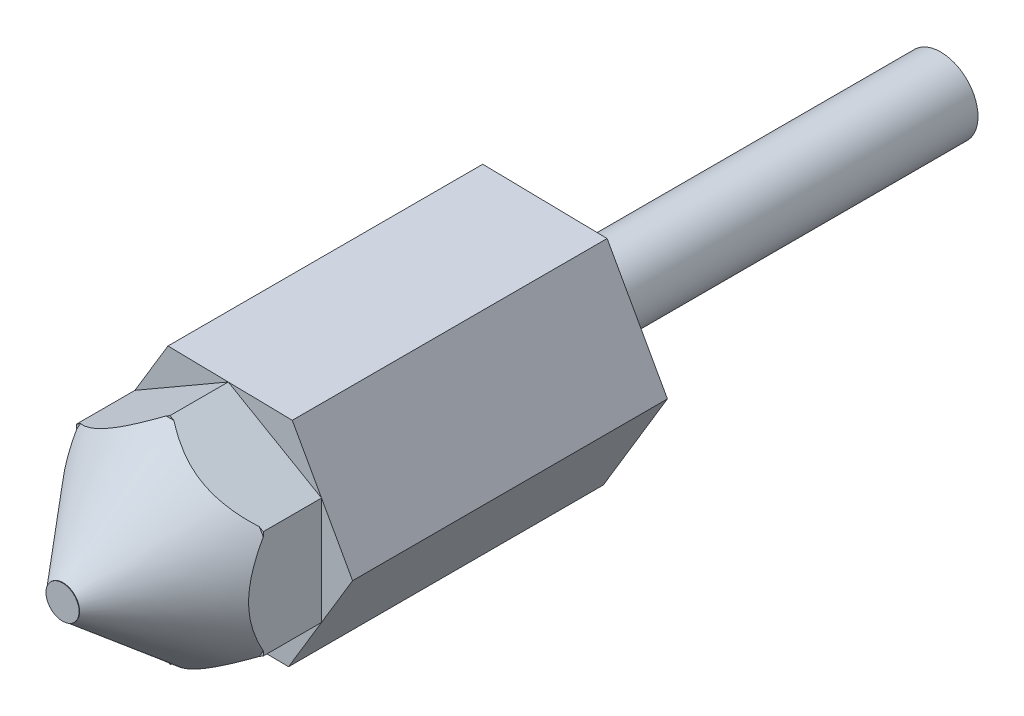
from build123d import *

# Parameters (mm, degrees)
SALIENTE_EXTRUIR1_DEPTH = 19
SALIENTE_EXTRUIR2_DEPTH = 10
CROQUIS7_R              = 2.25
SALIENTE_EXTRUIR3_DEPTH = 24


with BuildPart() as part:
    # Croquis1 → Saliente-Extruir1 (new body)
    with BuildSketch(Plane.XY):
        Polygon((3.866312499, 6.433114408), (-3.638084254, 6.564882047), (-7.504396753, 0.131767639), (-3.866312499, -6.433114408), (3.638084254, -6.564882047), (7.504396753, -0.131767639), align=None)
    extrude(amount=-SALIENTE_EXTRUIR1_DEPTH)

    # Croquis7 → Saliente-Extruir3 (add)
    with BuildSketch(Plane(origin=(0, 0, -19), x_dir=(-1, 0, 0), z_dir=(0, 0, -1))):
        with Locations(Location((0, 0, 0), (0, 0, 180))):
            Circle(CROQUIS7_R)
    extrude(amount=SALIENTE_EXTRUIR3_DEPTH)


with BuildPart() as body_2:
    # Croquis2 → Saliente-Extruir2 (new body)
    with BuildSketch(Plane.XY):
        Polygon((0, 6.501001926), (-5.630032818, 3.250500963), (-5.630032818, -3.250500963), (0, -6.501001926), (5.630032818, -3.250500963), (5.630032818, 3.250500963), align=None)
    extrude(amount=SALIENTE_EXTRUIR2_DEPTH)

    # Croquis6 → Cortar-Revoluci_n2 (revolve, cut)
    with BuildSketch(Plane(origin=(-1.6409e-05, 2.8422e-05, 0), x_dir=(0.866025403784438, 0.5000000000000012, 0), z_dir=(-0.5000000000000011, 0.8660254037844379, 0)), mode=Mode.PRIVATE) as cortar_revoluci_n2_sk:
        Polygon((7.700024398, -3.5157356), (6.367547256, -3.5157356), (1, -9.97014327), (1, -10.155913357), (7.700024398, -10.155913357), align=None)
    revolve(cortar_revoluci_n2_sk.sketch.rotate(Axis((-1.6409e-05, 2.8422e-05, 10.155913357), (0, 0, -1)), 237.850019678), axis=Axis((-1.6409e-05, 2.8422e-05, 10.155913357), (0, 0, -1)), mode=Mode.SUBTRACT)


solid = Compound([part.part, body_2.part])
